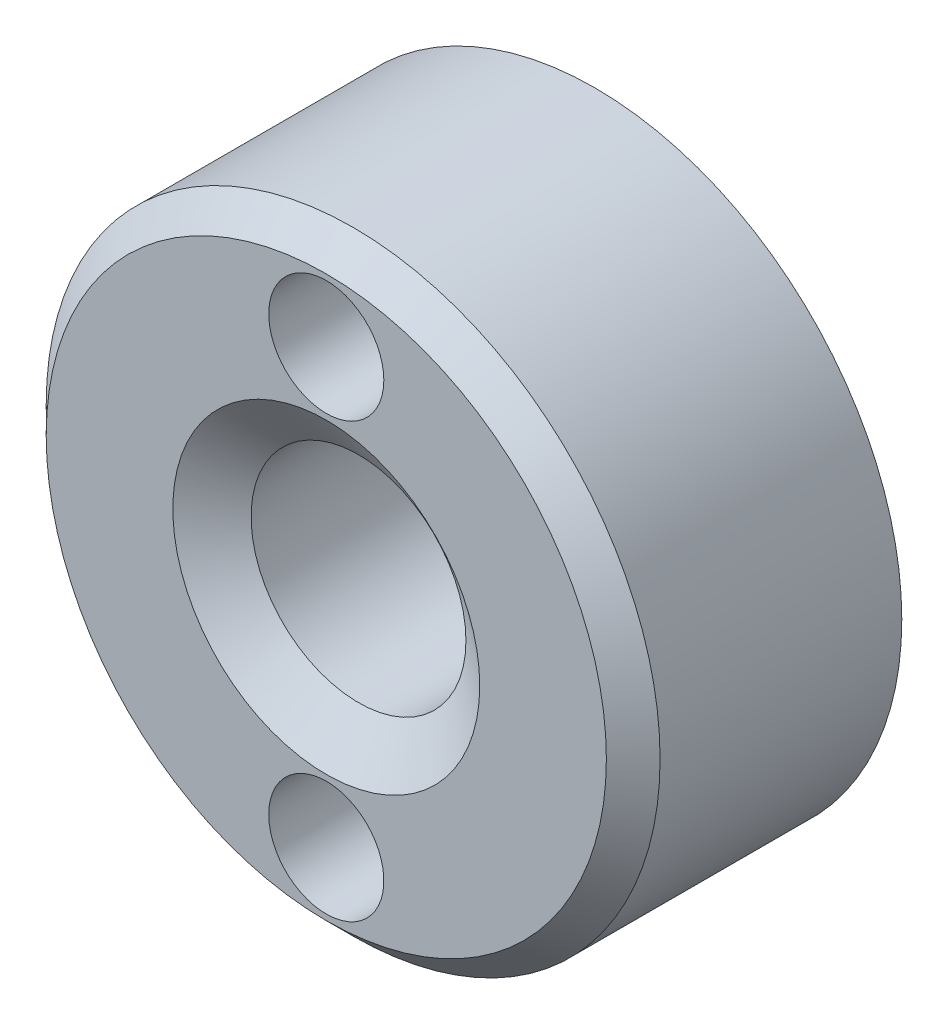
ISO-10303-21;
HEADER;
FILE_DESCRIPTION(('STEP AP214'),'2;1');
FILE_NAME('part.step','',(''),(''),'','','');
FILE_SCHEMA(('AUTOMOTIVE_DESIGN { 1 0 10303 214 1 1 1 1 }'));
ENDSEC;
DATA;
#1=APPLICATION_CONTEXT('core data for automotive mechanical design processes');
#2=APPLICATION_PROTOCOL_DEFINITION('international standard','automotive_design',2000,#1);
#3=PRODUCT_CONTEXT('',#1,'mechanical');
#4=PRODUCT('Part','Part','',(#3));
#5=PRODUCT_RELATED_PRODUCT_CATEGORY('part','',(#4));
#6=PRODUCT_DEFINITION_FORMATION('','',#4);
#7=PRODUCT_DEFINITION_CONTEXT('part definition',#1,'design');
#8=PRODUCT_DEFINITION('design','',#6,#7);
#9=PRODUCT_DEFINITION_SHAPE('','',#8);
#10=(LENGTH_UNIT() NAMED_UNIT(*) SI_UNIT(.MILLI.,.METRE.));
#11=(NAMED_UNIT(*) PLANE_ANGLE_UNIT() SI_UNIT($,.RADIAN.));
#12=(NAMED_UNIT(*) SI_UNIT($,.STERADIAN.) SOLID_ANGLE_UNIT());
#13=UNCERTAINTY_MEASURE_WITH_UNIT(LENGTH_MEASURE(1.E-05),#10,'distance_accuracy_value','');
#14=(GEOMETRIC_REPRESENTATION_CONTEXT(3) GLOBAL_UNCERTAINTY_ASSIGNED_CONTEXT((#13)) GLOBAL_UNIT_ASSIGNED_CONTEXT((#10,
#11,#12)) REPRESENTATION_CONTEXT('',''));
#15=CARTESIAN_POINT('',(0.,0.,0.));
#16=DIRECTION('',(0.,0.,1.));
#17=DIRECTION('',(1.,0.,0.));
#18=AXIS2_PLACEMENT_3D('',#15,#16,#17);
#19=CARTESIAN_POINT('',(0.,0.,-3.5));
#20=DIRECTION('',(0.,0.,1.));
#21=DIRECTION('',(1.,0.,0.));
#22=AXIS2_PLACEMENT_3D('',#19,#20,#21);
#23=CYLINDRICAL_SURFACE('',#22,1.4);
#24=CARTESIAN_POINT('',(0.,0.,-0.420124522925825));
#25=DIRECTION('',(0.,0.,1.));
#26=DIRECTION('',(1.,0.,0.));
#27=AXIS2_PLACEMENT_3D('',#24,#25,#26);
#28=CIRCLE('',#27,1.4);
#29=CARTESIAN_POINT('',(1.4,0.,-0.420124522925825));
#30=VERTEX_POINT('',#29);
#31=EDGE_CURVE('E104',#30,#30,#28,.F.);
#32=ORIENTED_EDGE('',*,*,#31,.F.);
#33=EDGE_LOOP('',(#32));
#34=FACE_BOUND('',#33,.T.);
#35=CARTESIAN_POINT('',(0.,0.,-3.05447547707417));
#36=DIRECTION('',(0.,0.,-1.));
#37=DIRECTION('',(-1.,0.,0.));
#38=AXIS2_PLACEMENT_3D('',#35,#36,#37);
#39=CIRCLE('',#38,1.4);
#40=CARTESIAN_POINT('',(-1.4,0.,-3.05447547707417));
#41=VERTEX_POINT('',#40);
#42=EDGE_CURVE('E105',#41,#41,#39,.F.);
#43=ORIENTED_EDGE('',*,*,#42,.F.);
#44=EDGE_LOOP('',(#43));
#45=FACE_BOUND('',#44,.T.);
#46=ADVANCED_FACE('F34',(#34,#45),#23,.F.);
#47=CARTESIAN_POINT('',(0.,0.,-3.5));
#48=DIRECTION('',(0.,0.,1.));
#49=DIRECTION('',(1.,0.,0.));
#50=AXIS2_PLACEMENT_3D('',#47,#48,#49);
#51=CYLINDRICAL_SURFACE('',#50,4.);
#52=CARTESIAN_POINT('',(0.,0.,-0.350000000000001));
#53=DIRECTION('',(0.,0.,1.));
#54=DIRECTION('',(1.,0.,0.));
#55=AXIS2_PLACEMENT_3D('',#52,#53,#54);
#56=CIRCLE('',#55,4.);
#57=CARTESIAN_POINT('',(4.,0.,-0.350000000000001));
#58=VERTEX_POINT('',#57);
#59=EDGE_CURVE('E11',#58,#58,#56,.F.);
#60=ORIENTED_EDGE('',*,*,#59,.T.);
#61=EDGE_LOOP('',(#60));
#62=FACE_BOUND('',#61,.T.);
#63=CARTESIAN_POINT('',(0.,0.,-3.5));
#64=DIRECTION('',(0.,0.,1.));
#65=DIRECTION('',(1.,0.,0.));
#66=AXIS2_PLACEMENT_3D('',#63,#64,#65);
#67=CIRCLE('',#66,4.);
#68=CARTESIAN_POINT('',(4.,0.,-3.5));
#69=VERTEX_POINT('',#68);
#70=EDGE_CURVE('E108',#69,#69,#67,.T.);
#71=ORIENTED_EDGE('',*,*,#70,.T.);
#72=EDGE_LOOP('',(#71));
#73=FACE_BOUND('',#72,.T.);
#74=ADVANCED_FACE('F65',(#62,#73),#51,.T.);
#75=CARTESIAN_POINT('',(0.,0.,-3.5));
#76=DIRECTION('',(0.,0.,1.));
#77=DIRECTION('',(1.,0.,0.));
#78=AXIS2_PLACEMENT_3D('',#75,#76,#77);
#79=PLANE('',#78);
#80=CARTESIAN_POINT('',(0.,0.,-3.5));
#81=DIRECTION('',(0.,0.,1.));
#82=DIRECTION('',(1.,0.,0.));
#83=AXIS2_PLACEMENT_3D('',#80,#81,#82);
#84=CIRCLE('',#83,2.);
#85=CARTESIAN_POINT('',(2.,0.,-3.5));
#86=VERTEX_POINT('',#85);
#87=EDGE_CURVE('E111',#86,#86,#84,.F.);
#88=ORIENTED_EDGE('',*,*,#87,.F.);
#89=EDGE_LOOP('',(#88));
#90=FACE_BOUND('',#89,.T.);
#91=ORIENTED_EDGE('',*,*,#70,.F.);
#92=EDGE_LOOP('',(#91));
#93=FACE_BOUND('',#92,.T.);
#94=ADVANCED_FACE('F71',(#90,#93),#79,.F.);
#95=CARTESIAN_POINT('',(0.,0.,0.));
#96=DIRECTION('',(0.,0.,1.));
#97=DIRECTION('',(1.,0.,0.));
#98=AXIS2_PLACEMENT_3D('',#95,#96,#97);
#99=PLANE('',#98);
#100=CARTESIAN_POINT('',(0.,-2.825,0.));
#101=DIRECTION('',(0.,0.,1.));
#102=DIRECTION('',(-1.,0.,0.));
#103=AXIS2_PLACEMENT_3D('',#100,#101,#102);
#104=CIRCLE('',#103,0.75);
#105=CARTESIAN_POINT('',(-0.749999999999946,-2.82500000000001,0.));
#106=VERTEX_POINT('',#105);
#107=EDGE_CURVE('E93',#106,#106,#104,.T.);
#108=ORIENTED_EDGE('',*,*,#107,.F.);
#109=EDGE_LOOP('',(#108));
#110=FACE_BOUND('',#109,.T.);
#111=CARTESIAN_POINT('',(0.,2.825,0.));
#112=DIRECTION('',(0.,0.,1.));
#113=DIRECTION('',(1.,0.,0.));
#114=AXIS2_PLACEMENT_3D('',#111,#112,#113);
#115=CIRCLE('',#114,0.75);
#116=CARTESIAN_POINT('',(0.75,2.825,0.));
#117=VERTEX_POINT('',#116);
#118=EDGE_CURVE('E97',#117,#117,#115,.T.);
#119=ORIENTED_EDGE('',*,*,#118,.F.);
#120=EDGE_LOOP('',(#119));
#121=FACE_BOUND('',#120,.T.);
#122=CARTESIAN_POINT('',(0.,0.,0.));
#123=DIRECTION('',(0.,0.,1.));
#124=DIRECTION('',(1.,0.,0.));
#125=AXIS2_PLACEMENT_3D('',#122,#123,#124);
#126=CIRCLE('',#125,3.65);
#127=CARTESIAN_POINT('',(3.65,0.,0.));
#128=VERTEX_POINT('',#127);
#129=EDGE_CURVE('E42',#128,#128,#126,.T.);
#130=ORIENTED_EDGE('',*,*,#129,.T.);
#131=EDGE_LOOP('',(#130));
#132=FACE_BOUND('',#131,.T.);
#133=CARTESIAN_POINT('',(0.,0.,0.));
#134=DIRECTION('',(0.,0.,1.));
#135=DIRECTION('',(1.,0.,0.));
#136=AXIS2_PLACEMENT_3D('',#133,#134,#135);
#137=CIRCLE('',#136,2.);
#138=CARTESIAN_POINT('',(2.,0.,0.));
#139=VERTEX_POINT('',#138);
#140=EDGE_CURVE('E103',#139,#139,#137,.T.);
#141=ORIENTED_EDGE('',*,*,#140,.F.);
#142=EDGE_LOOP('',(#141));
#143=FACE_BOUND('',#142,.T.);
#144=ADVANCED_FACE('F81',(#110,#121,#132,#143),#99,.T.);
#145=CARTESIAN_POINT('',(0.,0.,-0.462136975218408));
#146=DIRECTION('',(0.,0.,1.));
#147=DIRECTION('',(1.,0.,0.));
#148=AXIS2_PLACEMENT_3D('',#145,#146,#147);
#149=CONICAL_SURFACE('',#148,1.34,0.959931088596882);
#150=ORIENTED_EDGE('',*,*,#140,.T.);
#151=EDGE_LOOP('',(#150));
#152=FACE_BOUND('',#151,.T.);
#153=ORIENTED_EDGE('',*,*,#31,.T.);
#154=EDGE_LOOP('',(#153));
#155=FACE_BOUND('',#154,.T.);
#156=ADVANCED_FACE('F77',(#152,#155),#149,.F.);
#157=CARTESIAN_POINT('',(0.,0.,-3.4746));
#158=DIRECTION('',(0.,0.,-1.));
#159=DIRECTION('',(-1.,0.,0.));
#160=AXIS2_PLACEMENT_3D('',#157,#158,#159);
#161=CONICAL_SURFACE('',#160,2.,0.959931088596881);
#162=CARTESIAN_POINT('',(0.,0.,-3.4746));
#163=DIRECTION('',(0.,0.,1.));
#164=DIRECTION('',(1.,0.,0.));
#165=AXIS2_PLACEMENT_3D('',#162,#163,#164);
#166=CIRCLE('',#165,2.);
#167=CARTESIAN_POINT('',(2.,0.,-3.4746));
#168=VERTEX_POINT('',#167);
#169=EDGE_CURVE('E115',#168,#168,#166,.T.);
#170=ORIENTED_EDGE('',*,*,#169,.F.);
#171=EDGE_LOOP('',(#170));
#172=FACE_BOUND('',#171,.T.);
#173=ORIENTED_EDGE('',*,*,#42,.T.);
#174=EDGE_LOOP('',(#173));
#175=FACE_BOUND('',#174,.T.);
#176=ADVANCED_FACE('F88',(#172,#175),#161,.F.);
#177=CARTESIAN_POINT('',(0.,0.,-25.0375057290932));
#178=DIRECTION('',(0.,0.,1.));
#179=DIRECTION('',(1.,0.,0.));
#180=AXIS2_PLACEMENT_3D('',#177,#178,#179);
#181=CYLINDRICAL_SURFACE('',#180,2.);
#182=ORIENTED_EDGE('',*,*,#169,.T.);
#183=EDGE_LOOP('',(#182));
#184=FACE_BOUND('',#183,.T.);
#185=ORIENTED_EDGE('',*,*,#87,.T.);
#186=EDGE_LOOP('',(#185));
#187=FACE_BOUND('',#186,.T.);
#188=ADVANCED_FACE('F141',(#184,#187),#181,.F.);
#189=CARTESIAN_POINT('',(0.,0.,0.));
#190=DIRECTION('',(0.,0.,-1.));
#191=DIRECTION('',(-1.,0.,0.));
#192=AXIS2_PLACEMENT_3D('',#189,#190,#191);
#193=CONICAL_SURFACE('',#192,3.65,0.785398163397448);
#194=ORIENTED_EDGE('',*,*,#59,.F.);
#195=EDGE_LOOP('',(#194));
#196=FACE_BOUND('',#195,.T.);
#197=ORIENTED_EDGE('',*,*,#129,.F.);
#198=EDGE_LOOP('',(#197));
#199=FACE_BOUND('',#198,.T.);
#200=ADVANCED_FACE('F36',(#196,#199),#193,.T.);
#201=CARTESIAN_POINT('',(0.,2.825,-1.61066017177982));
#202=DIRECTION('',(0.,0.,1.));
#203=DIRECTION('',(1.,0.,0.));
#204=AXIS2_PLACEMENT_3D('',#201,#202,#203);
#205=CONICAL_SURFACE('',#204,0.,1.17809724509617);
#206=CARTESIAN_POINT('',(0.,2.825,-1.3));
#207=DIRECTION('',(0.,0.,1.));
#208=DIRECTION('',(1.,0.,0.));
#209=AXIS2_PLACEMENT_3D('',#206,#207,#208);
#210=CIRCLE('',#209,0.75);
#211=CARTESIAN_POINT('',(0.75,2.825,-1.3));
#212=VERTEX_POINT('',#211);
#213=EDGE_CURVE('E123',#212,#212,#210,.T.);
#214=ORIENTED_EDGE('',*,*,#213,.T.);
#215=EDGE_LOOP('',(#214));
#216=FACE_BOUND('',#215,.T.);
#217=CARTESIAN_POINT('',(0.,2.825,-1.61066017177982));
#218=VERTEX_POINT('',#217);
#219=VERTEX_LOOP('',#218);
#220=FACE_BOUND('',#219,.T.);
#221=ADVANCED_FACE('F60',(#216,#220),#205,.F.);
#222=CARTESIAN_POINT('',(0.,2.825,3.175));
#223=DIRECTION('',(0.,0.,1.));
#224=DIRECTION('',(1.,0.,0.));
#225=AXIS2_PLACEMENT_3D('',#222,#223,#224);
#226=CYLINDRICAL_SURFACE('',#225,0.75);
#227=ORIENTED_EDGE('',*,*,#118,.T.);
#228=EDGE_LOOP('',(#227));
#229=FACE_BOUND('',#228,.T.);
#230=ORIENTED_EDGE('',*,*,#213,.F.);
#231=EDGE_LOOP('',(#230));
#232=FACE_BOUND('',#231,.T.);
#233=ADVANCED_FACE('F51',(#229,#232),#226,.F.);
#234=CARTESIAN_POINT('',(0.,-2.825,-1.61066017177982));
#235=DIRECTION('',(0.,0.,1.));
#236=DIRECTION('',(-1.,0.,0.));
#237=AXIS2_PLACEMENT_3D('',#234,#235,#236);
#238=CONICAL_SURFACE('',#237,0.,1.17809724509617);
#239=CARTESIAN_POINT('',(0.,-2.825,-1.3));
#240=DIRECTION('',(0.,0.,1.));
#241=DIRECTION('',(-1.,0.,0.));
#242=AXIS2_PLACEMENT_3D('',#239,#240,#241);
#243=CIRCLE('',#242,0.75);
#244=CARTESIAN_POINT('',(-0.749999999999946,-2.82500000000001,-1.3));
#245=VERTEX_POINT('',#244);
#246=EDGE_CURVE('E129',#245,#245,#243,.T.);
#247=ORIENTED_EDGE('',*,*,#246,.T.);
#248=EDGE_LOOP('',(#247));
#249=FACE_BOUND('',#248,.T.);
#250=CARTESIAN_POINT('',(0.,-2.825,-1.61066017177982));
#251=VERTEX_POINT('',#250);
#252=VERTEX_LOOP('',#251);
#253=FACE_BOUND('',#252,.T.);
#254=ADVANCED_FACE('F48',(#249,#253),#238,.F.);
#255=CARTESIAN_POINT('',(0.,-2.825,3.175));
#256=DIRECTION('',(0.,0.,1.));
#257=DIRECTION('',(-1.,0.,0.));
#258=AXIS2_PLACEMENT_3D('',#255,#256,#257);
#259=CYLINDRICAL_SURFACE('',#258,0.75);
#260=ORIENTED_EDGE('',*,*,#107,.T.);
#261=EDGE_LOOP('',(#260));
#262=FACE_BOUND('',#261,.T.);
#263=ORIENTED_EDGE('',*,*,#246,.F.);
#264=EDGE_LOOP('',(#263));
#265=FACE_BOUND('',#264,.T.);
#266=ADVANCED_FACE('F50',(#262,#265),#259,.F.);
#267=CLOSED_SHELL('',(#46,#74,#94,#144,#156,#176,#188,#200,#221,#233,#254,#266));
#268=MANIFOLD_SOLID_BREP('B2',#267);
#269=ADVANCED_BREP_SHAPE_REPRESENTATION('',(#18,#268),#14);
#270=SHAPE_DEFINITION_REPRESENTATION(#9,#269);
ENDSEC;
END-ISO-10303-21;
